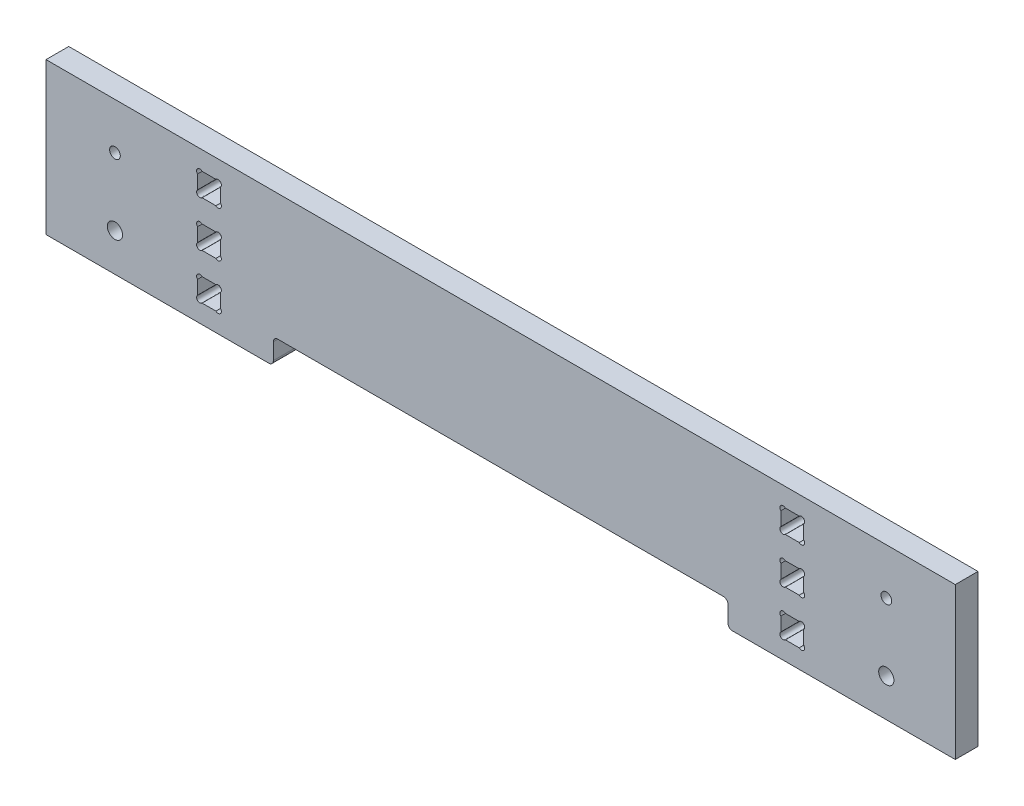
from build123d import *

# Parameters (mm, degrees)
AUFSATZ_LINEAR_AUSTRAGEN1_DEPTH = 15
SKIZZE2_R                       = 3.525
SKIZZE2_R_2                     = 3
SCHNITT_LINEAR_AUSTRAGEN1_DEPTH = 15
SKIZZE4_R                       = 5.025
SCHNITT_LINEAR_AUSTRAGEN2_DEPTH = 7.5
VERRUNDUNG1_R                   = 3


with BuildPart() as part:
    # Skizze1 → Aufsatz-Linear austragen1 (new body)
    with BuildSketch(Plane.XY):
        Polygon((0, 0), (150, 0), (150, 16.704326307), (450, 16.704326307), (450, 0), (600, 0), (600, 100), (0, 100), align=None)
    extrude(amount=AUFSATZ_LINEAR_AUSTRAGEN1_DEPTH)

    # Skizze2 → Schnitt-Linear austragen1 (cut)
    with BuildSketch(Plane.XY.offset(15)):
        with Locations((554.5, 69.5)):
            Circle(SKIZZE2_R)
        with Locations((554.5, 25)):
            Circle(SKIZZE2_R_2)
        with Locations((45.5, 69.5)):
            Circle(SKIZZE2_R)
        with Locations((45.5, 25)):
            Circle(SKIZZE2_R_2)
        with BuildLine():
            Line((115.1, 45.45), (115.1, 54.55))
            ThreePointArc((115.1, 54.55), (115.1, 57.55), (112.1, 57.55))
            Line((112.1, 57.55), (103, 57.55))
            ThreePointArc((103, 57.55), (100, 57.55), (100, 54.55))
            Line((100, 54.55), (100, 45.45))
            ThreePointArc((100, 45.45), (100, 42.45), (103, 42.45))
            Line((103, 42.45), (112.1, 42.45))
            ThreePointArc((112.1, 42.45), (115.1, 42.45), (115.1, 45.45))
        make_face()
        with BuildLine():
            Line((115.1, 75.55), (115.1, 84.65))
            ThreePointArc((115.1, 84.65), (115.1, 87.65), (112.1, 87.650000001))
            Line((112.1, 87.650000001), (103, 87.650000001))
            ThreePointArc((103, 87.650000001), (100, 87.65), (100, 84.65))
            Line((100, 84.65), (100, 75.55))
            ThreePointArc((100, 75.55), (100, 72.55), (103, 72.55))
            Line((103, 72.55), (112.1, 72.55))
            ThreePointArc((112.1, 72.55), (115.1, 72.55), (115.1, 75.55))
        make_face()
        with BuildLine():
            Line((115.1, 15.35), (115.1, 24.45))
            ThreePointArc((115.1, 24.45), (115.1, 27.45), (112.1, 27.45))
            Line((112.1, 27.45), (103, 27.45))
            ThreePointArc((103, 27.45), (100, 27.45), (100, 24.45))
            Line((100, 24.45), (100, 15.35))
            ThreePointArc((100, 15.35), (100, 12.35), (103, 12.35))
            Line((103, 12.35), (112.1, 12.35))
            ThreePointArc((112.1, 12.35), (115.1, 12.35), (115.1, 15.35))
        make_face()
        with BuildLine():
            Line((500, 84.65), (500, 75.55))
            ThreePointArc((500, 75.55), (500, 72.55), (497, 72.55))
            Line((497, 72.55), (487.9, 72.55))
            ThreePointArc((487.9, 72.55), (484.9, 72.55), (484.9, 75.55))
            Line((484.9, 75.55), (484.9, 84.65))
            ThreePointArc((484.9, 84.65), (484.9, 87.65), (487.9, 87.65))
            Line((487.9, 87.65), (497, 87.65))
            ThreePointArc((497, 87.65), (500, 87.65), (500, 84.65))
        make_face()
        with BuildLine():
            Line((500, 45.45), (500, 54.55))
            ThreePointArc((500, 54.55), (500, 57.55), (497, 57.55))
            Line((497, 57.55), (487.9, 57.55))
            ThreePointArc((487.9, 57.55), (484.9, 57.55), (484.9, 54.55))
            Line((484.9, 54.55), (484.9, 45.45))
            ThreePointArc((484.9, 45.45), (484.9, 42.45), (487.9, 42.45))
            Line((487.9, 42.45), (497, 42.45))
            ThreePointArc((497, 42.45), (500, 42.45), (500, 45.45))
        make_face()
        with BuildLine():
            Line((500, 15.349999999), (500, 24.449999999))
            ThreePointArc((500, 24.449999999), (500, 27.45), (497, 27.45))
            Line((497, 27.45), (487.9, 27.45))
            ThreePointArc((487.9, 27.45), (484.9, 27.45), (484.9, 24.449999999))
            Line((484.9, 24.449999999), (484.9, 15.349999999))
            ThreePointArc((484.9, 15.349999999), (484.9, 12.349999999), (487.9, 12.349999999))
            Line((487.9, 12.349999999), (497, 12.349999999))
            ThreePointArc((497, 12.349999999), (500, 12.349999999), (500, 15.349999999))
        make_face()
    extrude(amount=-SCHNITT_LINEAR_AUSTRAGEN1_DEPTH, mode=Mode.SUBTRACT)

    # Skizze4 → Schnitt-Linear austragen2 (cut)
    with BuildSketch(Plane.XY.offset(15)):
        with Locations((554.5, 25)):
            Circle(SKIZZE4_R)
        with Locations((45.5, 25)):
            Circle(SKIZZE4_R)
    extrude(amount=-SCHNITT_LINEAR_AUSTRAGEN2_DEPTH, mode=Mode.SUBTRACT)

    # Verrundung1
    verrundung1_edges = [part.edges().sort_by_distance(p)[0] for p in [
        (450, 0, 7.5),
        (450, 16.704326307, 7.5),
        (150, 16.704326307, 7.5),
        (150, 0, 7.5),
    ]]
    fillet(verrundung1_edges, radius=VERRUNDUNG1_R)


solid = part.part
